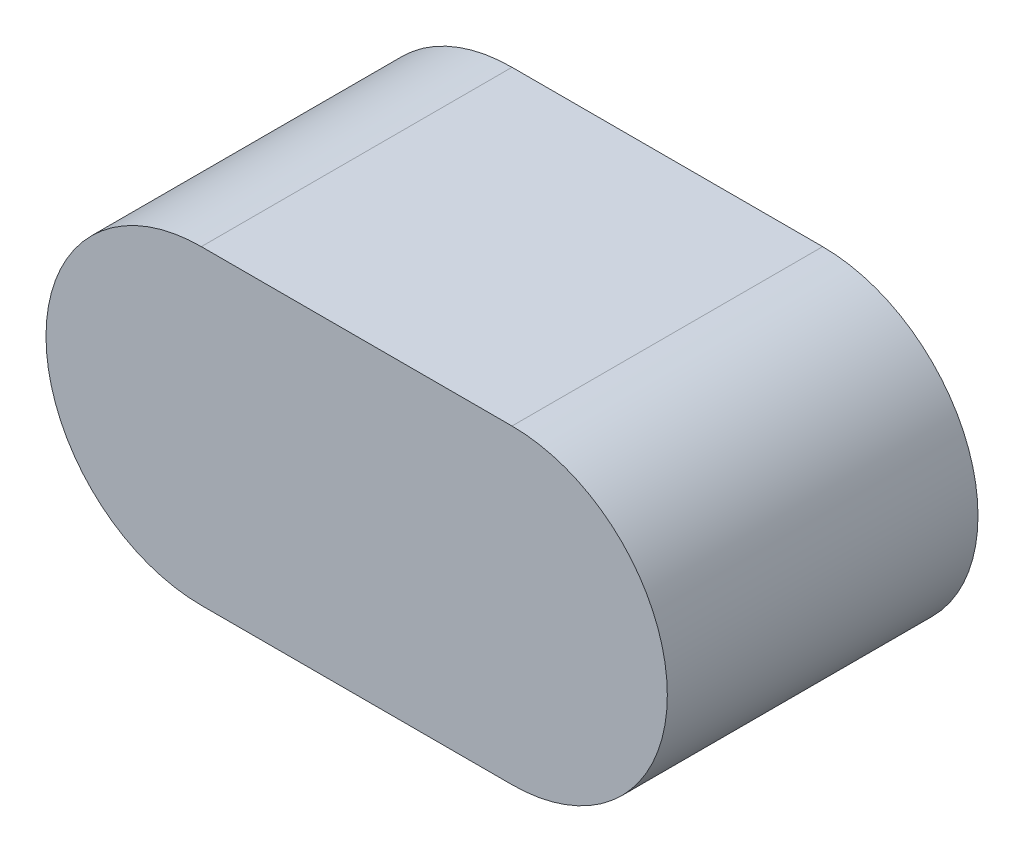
from build123d import *

# Parameters (mm, degrees)
BASE_EXTRUSION_DEPTH = 5


with BuildPart() as part:
    # Esquisse1 → Base-Extrusion (new body)
    with BuildSketch(Plane.XY):
        with BuildLine():
            Line((0, 2.5), (5, 2.5))
            ThreePointArc((5, 2.5), (7.5, 0), (5, -2.5))
            Line((5, -2.5), (0, -2.5))
            ThreePointArc((0, -2.5), (-2.5, 0), (0, 2.5))
        make_face()
    extrude(amount=BASE_EXTRUSION_DEPTH)


solid = part.part
